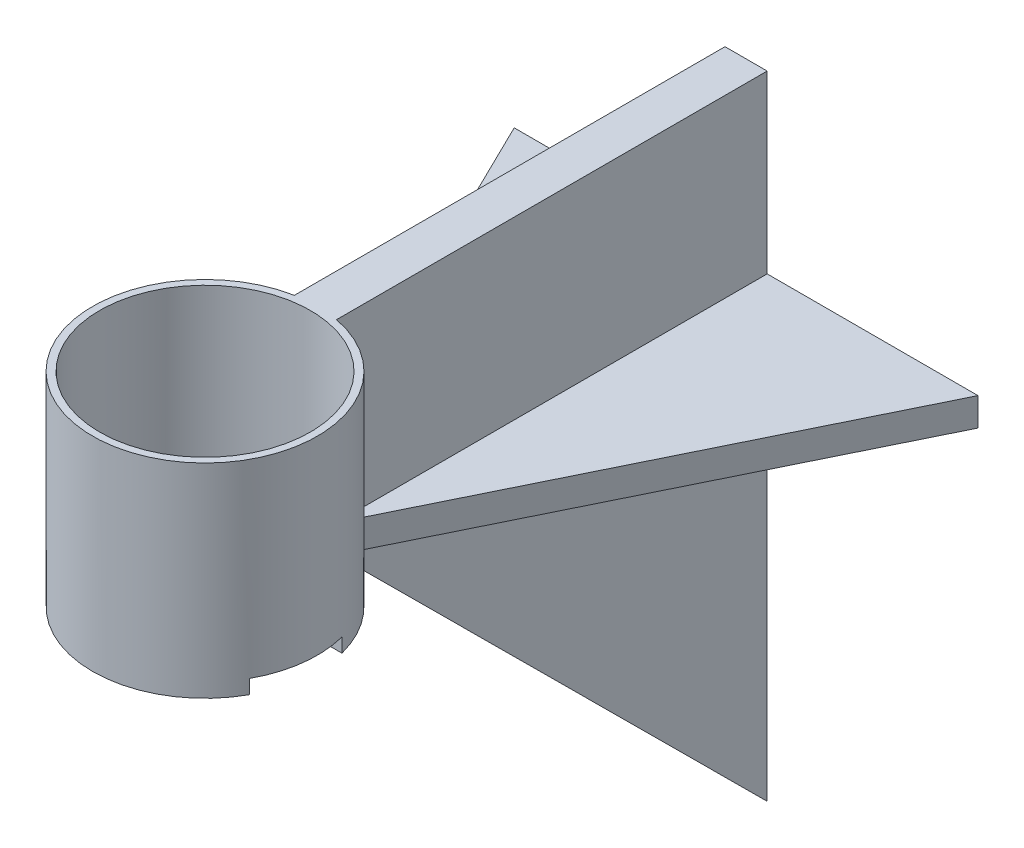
from build123d import *

# Parameters (mm, degrees)
SKETCH2_R           = 20.32
SKETCH2_R_2         = 19.05
BOSS_EXTRUDE1_DEPTH = 35.56
SKETCH3_R           = 20.32
BOSS_EXTRUDE2_DEPTH = 1.27
CUT_EXTRUDE2_DEPTH  = 2.54
SKETCH6_W           = 7.62
SKETCH6_H           = 78.74
BOSS_EXTRUDE3_DEPTH = 36.83
BOSS_EXTRUDE4_DEPTH = 7.62
BOSS_EXTRUDE6_DEPTH = 5.08
CUT_EXTRUDE3_DEPTH  = 76.2


with BuildPart() as part:
    # Sketch2 → Boss-Extrude1 (new body)
    with BuildSketch(Plane(origin=(0, 0, 0), x_dir=(1, 0, 0), z_dir=(0, 1, 0))):
        with Locations(Location((0, 0, 0), (0, 0, 270))):
            Circle(SKETCH2_R)
        with Locations(Location((0, 0, 0), (0, 0, 270))):
            Circle(SKETCH2_R_2, mode=Mode.SUBTRACT)
    extrude(amount=-BOSS_EXTRUDE1_DEPTH)

    # Sketch3 → Boss-Extrude2 (add)
    with BuildSketch(Plane(origin=(0, -35.56, 0), x_dir=(-1, 0, 0), z_dir=(0, -1, 0))):
        with Locations(Location((0, 0, 0), (0, 0, 270))):
            Circle(SKETCH3_R)
    extrude(amount=BOSS_EXTRUDE2_DEPTH)

    # Sketch4 → Cut-Extrude2 (cut)
    with BuildSketch(Plane(origin=(0, -36.83, 0), x_dir=(-1, 0, 0), z_dir=(0, -1, 0))):
        with BuildLine():
            Line((14.594755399, -5.08), (-14.604217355, -5.08))
            ThreePointArc((-14.604217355, -5.08), (-21.883469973, -9.659267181), (-22.86, -1.115053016))
            Line((-22.86, -1.115053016), (-22.86, 5.08))
            Line((-22.86, 5.08), (22.86, 5.08))
            Line((22.86, 5.08), (22.86, -1.122650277))
            ThreePointArc((22.86, -1.122650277), (21.868537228, -9.66189058), (14.594755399, -5.08))
        make_face()
    extrude(amount=-CUT_EXTRUDE2_DEPTH, mode=Mode.SUBTRACT)

    # Sketch6 → Boss-Extrude3 (add)
    with BuildSketch(Plane(origin=(0, 0, 0), x_dir=(1, 0, 0), z_dir=(0, 1, 0))):
        with Locations((0, 58.42)):
            Rectangle(SKETCH6_W, SKETCH6_H)
    extrude(amount=-BOSS_EXTRUDE3_DEPTH)

    # Sketch8 → Boss-Extrude4 (add)
    with BuildSketch(Plane(origin=(3.81, 0, 0), x_dir=(0, 0, -1), z_dir=(1, 0, 0))):
        Polygon((97.79, -36.83), (97.79, -114.3), (19.95961673, -36.83), align=None)
    extrude(amount=-BOSS_EXTRUDE4_DEPTH)

    # Sketch10 → Boss-Extrude6 (add)
    with BuildSketch(Plane(origin=(0, -36.83, 0), x_dir=(-1, 0, 0), z_dir=(0, -1, 0))):
        Polygon((3.81, 19.95961673), (41.91, 97.79), (3.81, 97.79), (-3.81, 97.79), (-41.91, 97.79), (-3.81, 19.95961673), align=None)
    extrude(amount=-BOSS_EXTRUDE6_DEPTH)

    # Sketch11 → Cut-Extrude3 (cut)
    with BuildSketch(Plane(origin=(0, -114.3, 0), x_dir=(-1, 0, 0), z_dir=(0, -1, 0))):
        Polygon((0, 97.79), (2.286, 97.79), (2.286, 93.218), (-2.286, 93.218), (-2.286, 97.79), align=None)
    extrude(amount=-CUT_EXTRUDE3_DEPTH, mode=Mode.SUBTRACT)


solid = part.part
